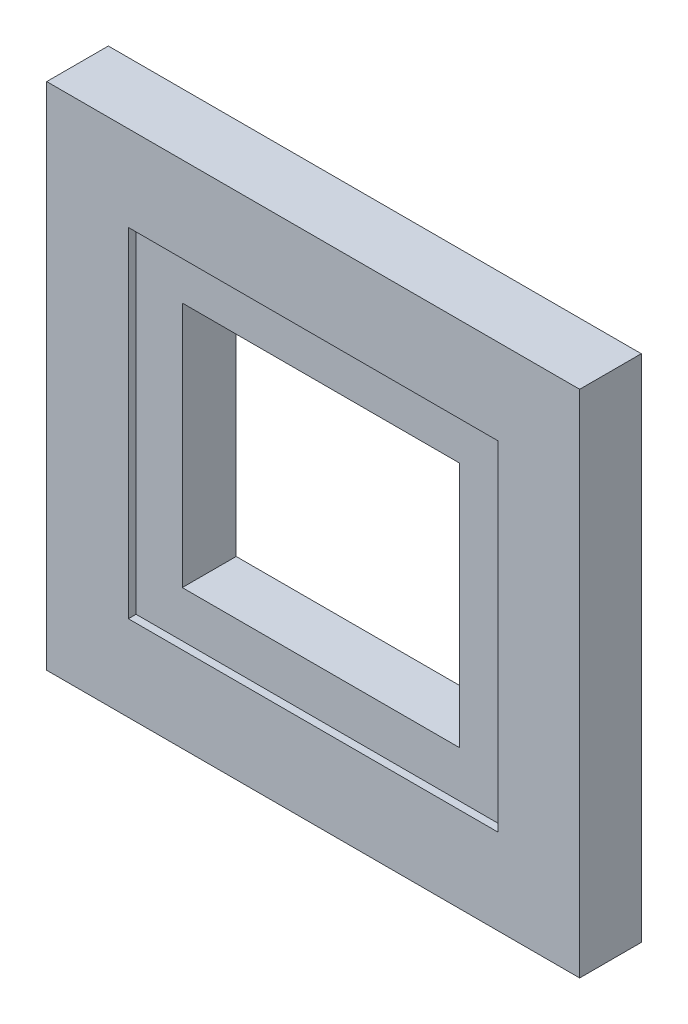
from build123d import *

# Parameters (mm, degrees)
SKETCH1_W           = 165.1
SKETCH1_H           = 155.575
BOSS_EXTRUDE1_DEPTH = 25.4
SKETCH2_W           = 152.4
SKETCH2_H           = 139.7
CUT_EXTRUDE1_DEPTH  = 3.175
SKETCH3_W           = 114.3
SKETCH3_H           = 101.6
CUT_EXTRUDE2_DEPTH  = 116.582646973
SKETCH4_W           = 219.7
SKETCH4_H           = 210.175
SKETCH4_W_2         = 165.1
SKETCH4_H_2         = 155.575
BOSS_EXTRUDE2_DEPTH = 25.4


with BuildPart() as part:
    # Sketch1 → Boss-Extrude1 (new body)
    with BuildSketch(Plane.XY):
        Rectangle(SKETCH1_W, SKETCH1_H)
    extrude(amount=BOSS_EXTRUDE1_DEPTH)

    # Sketch2 → Cut-Extrude1 (cut)
    with BuildSketch(Plane.XY.offset(25.4)):
        Rectangle(SKETCH2_W, SKETCH2_H)
    extrude(amount=-CUT_EXTRUDE1_DEPTH, mode=Mode.SUBTRACT)

    # Sketch3 → Cut-Extrude2 (cut, through all)
    with BuildSketch(Plane.XY.offset(22.225)):
        Rectangle(SKETCH3_W, SKETCH3_H)
    extrude(amount=-CUT_EXTRUDE2_DEPTH, mode=Mode.SUBTRACT)

    # Sketch4 → Boss-Extrude2 (add)
    with BuildSketch(Plane.XY.offset(25.4)):
        Rectangle(SKETCH4_W, SKETCH4_H)
        Rectangle(SKETCH4_W_2, SKETCH4_H_2, mode=Mode.SUBTRACT)
    extrude(amount=-BOSS_EXTRUDE2_DEPTH)


solid = part.part
